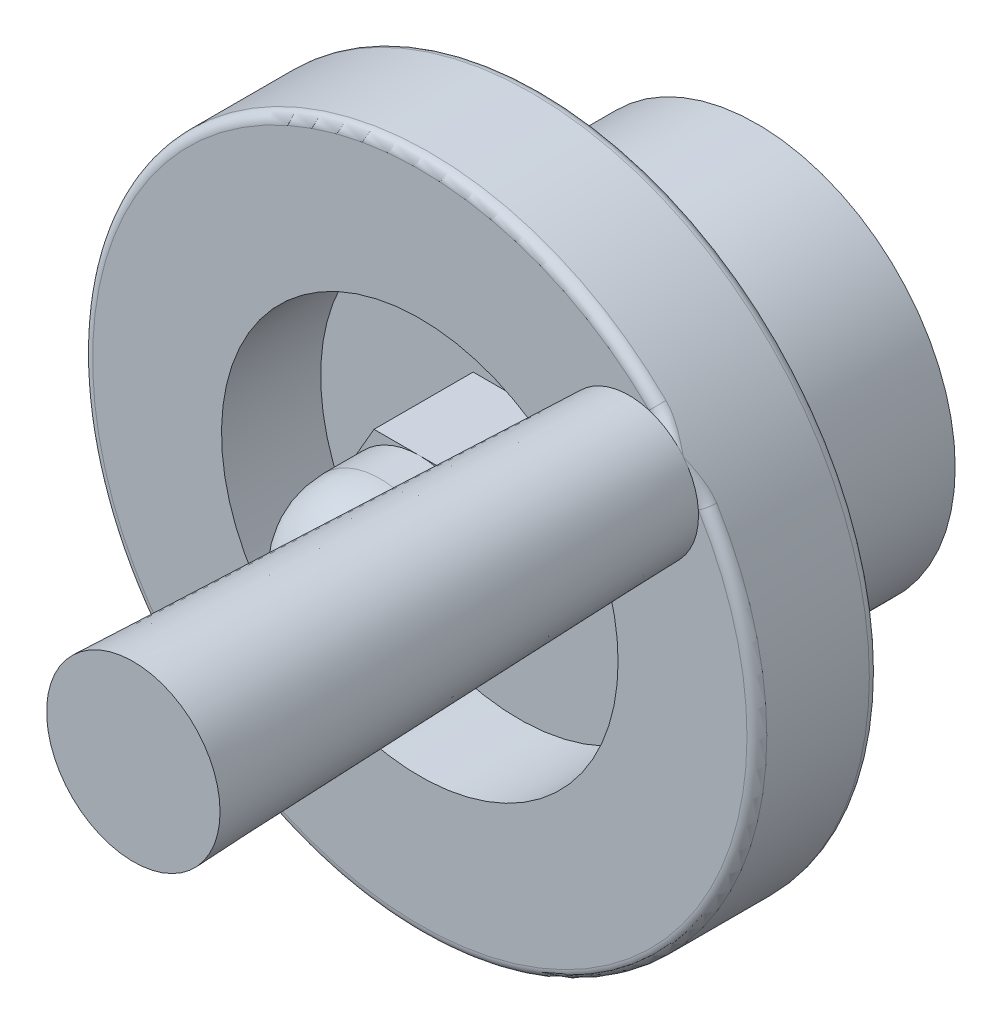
ISO-10303-21;
HEADER;
FILE_DESCRIPTION(('STEP AP214'),'2;1');
FILE_NAME('part.step','',(''),(''),'','','');
FILE_SCHEMA(('AUTOMOTIVE_DESIGN { 1 0 10303 214 1 1 1 1 }'));
ENDSEC;
DATA;
#1=APPLICATION_CONTEXT('core data for automotive mechanical design processes');
#2=APPLICATION_PROTOCOL_DEFINITION('international standard','automotive_design',2000,#1);
#3=PRODUCT_CONTEXT('',#1,'mechanical');
#4=PRODUCT('Part','Part','',(#3));
#5=PRODUCT_RELATED_PRODUCT_CATEGORY('part','',(#4));
#6=PRODUCT_DEFINITION_FORMATION('','',#4);
#7=PRODUCT_DEFINITION_CONTEXT('part definition',#1,'design');
#8=PRODUCT_DEFINITION('design','',#6,#7);
#9=PRODUCT_DEFINITION_SHAPE('','',#8);
#10=(LENGTH_UNIT() NAMED_UNIT(*) SI_UNIT(.MILLI.,.METRE.));
#11=(NAMED_UNIT(*) PLANE_ANGLE_UNIT() SI_UNIT($,.RADIAN.));
#12=(NAMED_UNIT(*) SI_UNIT($,.STERADIAN.) SOLID_ANGLE_UNIT());
#13=UNCERTAINTY_MEASURE_WITH_UNIT(LENGTH_MEASURE(1.E-05),#10,'distance_accuracy_value','');
#14=(GEOMETRIC_REPRESENTATION_CONTEXT(3) GLOBAL_UNCERTAINTY_ASSIGNED_CONTEXT((#13)) GLOBAL_UNIT_ASSIGNED_CONTEXT((#10,
#11,#12)) REPRESENTATION_CONTEXT('',''));
#15=CARTESIAN_POINT('',(0.,0.,0.));
#16=DIRECTION('',(0.,0.,1.));
#17=DIRECTION('',(1.,0.,0.));
#18=AXIS2_PLACEMENT_3D('',#15,#16,#17);
#19=CARTESIAN_POINT('',(0.,0.,17.));
#20=DIRECTION('',(0.,0.,1.));
#21=DIRECTION('',(1.,0.,0.));
#22=AXIS2_PLACEMENT_3D('',#19,#20,#21);
#23=PLANE('',#22);
#24=CARTESIAN_POINT('',(0.,0.,17.));
#25=DIRECTION('',(0.,0.,1.));
#26=DIRECTION('',(1.,0.,0.));
#27=AXIS2_PLACEMENT_3D('',#24,#25,#26);
#28=CIRCLE('',#27,4.);
#29=CARTESIAN_POINT('',(3.46410161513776,2.,17.));
#30=VERTEX_POINT('',#29);
#31=CARTESIAN_POINT('',(0.,4.00000000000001,17.));
#32=VERTEX_POINT('',#31);
#33=EDGE_CURVE('E163',#30,#32,#28,.T.);
#34=ORIENTED_EDGE('',*,*,#33,.F.);
#35=DIRECTION('',(-0.5,0.866025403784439,0.));
#36=VECTOR('',#35,1.);
#37=CARTESIAN_POINT('',(4.61880215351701,0.,17.));
#38=LINE('',#37,#36);
#39=CARTESIAN_POINT('',(2.3094010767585,4.00000000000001,17.));
#40=VERTEX_POINT('',#39);
#41=EDGE_CURVE('E291',#30,#40,#38,.T.);
#42=ORIENTED_EDGE('',*,*,#41,.T.);
#43=DIRECTION('',(-1.,0.,0.));
#44=VECTOR('',#43,1.);
#45=CARTESIAN_POINT('',(2.3094010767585,4.00000000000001,17.));
#46=LINE('',#45,#44);
#47=EDGE_CURVE('E294',#40,#32,#46,.T.);
#48=ORIENTED_EDGE('',*,*,#47,.T.);
#49=EDGE_LOOP('',(#34,#42,#48));
#50=FACE_BOUND('',#49,.T.);
#51=ADVANCED_FACE('F46',(#50),#23,.T.);
#52=CARTESIAN_POINT('',(-3.46410161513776,2.,17.));
#53=VERTEX_POINT('',#52);
#54=EDGE_CURVE('E299',#32,#53,#28,.T.);
#55=ORIENTED_EDGE('',*,*,#54,.F.);
#56=CARTESIAN_POINT('',(-2.3094010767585,4.00000000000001,17.));
#57=VERTEX_POINT('',#56);
#58=EDGE_CURVE('E318',#32,#57,#46,.T.);
#59=ORIENTED_EDGE('',*,*,#58,.T.);
#60=DIRECTION('',(-0.5,-0.866025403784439,0.));
#61=VECTOR('',#60,1.);
#62=CARTESIAN_POINT('',(-2.3094010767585,4.00000000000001,17.));
#63=LINE('',#62,#61);
#64=EDGE_CURVE('E321',#57,#53,#63,.T.);
#65=ORIENTED_EDGE('',*,*,#64,.T.);
#66=EDGE_LOOP('',(#55,#59,#65));
#67=FACE_BOUND('',#66,.T.);
#68=ADVANCED_FACE('F279',(#67),#23,.T.);
#69=CARTESIAN_POINT('',(-3.46410161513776,-2.,17.));
#70=VERTEX_POINT('',#69);
#71=EDGE_CURVE('E659',#53,#70,#28,.T.);
#72=ORIENTED_EDGE('',*,*,#71,.F.);
#73=CARTESIAN_POINT('',(-4.61880215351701,0.,17.));
#74=VERTEX_POINT('',#73);
#75=EDGE_CURVE('E320',#53,#74,#63,.T.);
#76=ORIENTED_EDGE('',*,*,#75,.T.);
#77=DIRECTION('',(0.5,-0.866025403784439,0.));
#78=VECTOR('',#77,1.);
#79=CARTESIAN_POINT('',(-4.61880215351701,0.,17.));
#80=LINE('',#79,#78);
#81=EDGE_CURVE('E325',#74,#70,#80,.T.);
#82=ORIENTED_EDGE('',*,*,#81,.T.);
#83=EDGE_LOOP('',(#72,#76,#82));
#84=FACE_BOUND('',#83,.T.);
#85=ADVANCED_FACE('F284',(#84),#23,.T.);
#86=CARTESIAN_POINT('',(0.,-4.00000000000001,17.));
#87=VERTEX_POINT('',#86);
#88=EDGE_CURVE('E306',#70,#87,#28,.T.);
#89=ORIENTED_EDGE('',*,*,#88,.F.);
#90=CARTESIAN_POINT('',(-2.3094010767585,-4.00000000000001,17.));
#91=VERTEX_POINT('',#90);
#92=EDGE_CURVE('E324',#70,#91,#80,.T.);
#93=ORIENTED_EDGE('',*,*,#92,.T.);
#94=DIRECTION('',(1.,0.,0.));
#95=VECTOR('',#94,1.);
#96=CARTESIAN_POINT('',(-2.3094010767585,-4.00000000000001,17.));
#97=LINE('',#96,#95);
#98=EDGE_CURVE('E329',#91,#87,#97,.T.);
#99=ORIENTED_EDGE('',*,*,#98,.T.);
#100=EDGE_LOOP('',(#89,#93,#99));
#101=FACE_BOUND('',#100,.T.);
#102=ADVANCED_FACE('F549',(#101),#23,.T.);
#103=CARTESIAN_POINT('',(3.46410161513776,-2.,17.));
#104=VERTEX_POINT('',#103);
#105=EDGE_CURVE('E303',#87,#104,#28,.T.);
#106=ORIENTED_EDGE('',*,*,#105,.F.);
#107=CARTESIAN_POINT('',(2.3094010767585,-4.00000000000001,17.));
#108=VERTEX_POINT('',#107);
#109=EDGE_CURVE('E328',#87,#108,#97,.T.);
#110=ORIENTED_EDGE('',*,*,#109,.T.);
#111=DIRECTION('',(0.5,0.866025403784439,0.));
#112=VECTOR('',#111,1.);
#113=CARTESIAN_POINT('',(2.3094010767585,-4.00000000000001,17.));
#114=LINE('',#113,#112);
#115=EDGE_CURVE('E312',#108,#104,#114,.T.);
#116=ORIENTED_EDGE('',*,*,#115,.T.);
#117=EDGE_LOOP('',(#106,#110,#116));
#118=FACE_BOUND('',#117,.T.);
#119=ADVANCED_FACE('F241',(#118),#23,.T.);
#120=CARTESIAN_POINT('',(0.,0.,12.));
#121=DIRECTION('',(0.,0.,1.));
#122=DIRECTION('',(1.,0.,0.));
#123=AXIS2_PLACEMENT_3D('',#120,#121,#122);
#124=PLANE('',#123);
#125=CARTESIAN_POINT('',(0.,0.,12.));
#126=DIRECTION('',(0.,0.,1.));
#127=DIRECTION('',(1.,0.,0.));
#128=AXIS2_PLACEMENT_3D('',#125,#126,#127);
#129=CIRCLE('',#128,10.);
#130=CARTESIAN_POINT('',(10.,0.,12.));
#131=VERTEX_POINT('',#130);
#132=EDGE_CURVE('E308',#131,#131,#129,.T.);
#133=ORIENTED_EDGE('',*,*,#132,.T.);
#134=EDGE_LOOP('',(#133));
#135=FACE_BOUND('',#134,.T.);
#136=DIRECTION('',(-0.5,0.866025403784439,0.));
#137=VECTOR('',#136,1.);
#138=CARTESIAN_POINT('',(4.61880215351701,0.,12.));
#139=LINE('',#138,#137);
#140=CARTESIAN_POINT('',(4.61880215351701,0.,12.));
#141=VERTEX_POINT('',#140);
#142=CARTESIAN_POINT('',(2.3094010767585,4.00000000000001,12.));
#143=VERTEX_POINT('',#142);
#144=EDGE_CURVE('E336',#141,#143,#139,.T.);
#145=ORIENTED_EDGE('',*,*,#144,.F.);
#146=DIRECTION('',(0.5,0.866025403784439,0.));
#147=VECTOR('',#146,1.);
#148=CARTESIAN_POINT('',(2.3094010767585,-4.00000000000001,12.));
#149=LINE('',#148,#147);
#150=CARTESIAN_POINT('',(2.3094010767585,-4.00000000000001,12.));
#151=VERTEX_POINT('',#150);
#152=EDGE_CURVE('E333',#151,#141,#149,.T.);
#153=ORIENTED_EDGE('',*,*,#152,.F.);
#154=DIRECTION('',(1.,0.,0.));
#155=VECTOR('',#154,1.);
#156=CARTESIAN_POINT('',(-2.3094010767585,-4.00000000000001,12.));
#157=LINE('',#156,#155);
#158=CARTESIAN_POINT('',(-2.3094010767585,-4.00000000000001,12.));
#159=VERTEX_POINT('',#158);
#160=EDGE_CURVE('E345',#159,#151,#157,.T.);
#161=ORIENTED_EDGE('',*,*,#160,.F.);
#162=DIRECTION('',(0.5,-0.866025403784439,0.));
#163=VECTOR('',#162,1.);
#164=CARTESIAN_POINT('',(-4.61880215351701,0.,12.));
#165=LINE('',#164,#163);
#166=CARTESIAN_POINT('',(-4.61880215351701,0.,12.));
#167=VERTEX_POINT('',#166);
#168=EDGE_CURVE('E342',#167,#159,#165,.T.);
#169=ORIENTED_EDGE('',*,*,#168,.F.);
#170=DIRECTION('',(-0.5,-0.866025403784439,0.));
#171=VECTOR('',#170,1.);
#172=CARTESIAN_POINT('',(-2.3094010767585,4.00000000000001,12.));
#173=LINE('',#172,#171);
#174=CARTESIAN_POINT('',(-2.3094010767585,4.00000000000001,12.));
#175=VERTEX_POINT('',#174);
#176=EDGE_CURVE('E340',#175,#167,#173,.T.);
#177=ORIENTED_EDGE('',*,*,#176,.F.);
#178=DIRECTION('',(-1.,0.,0.));
#179=VECTOR('',#178,1.);
#180=CARTESIAN_POINT('',(2.3094010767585,4.00000000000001,12.));
#181=LINE('',#180,#179);
#182=EDGE_CURVE('E338',#143,#175,#181,.T.);
#183=ORIENTED_EDGE('',*,*,#182,.F.);
#184=EDGE_LOOP('',(#145,#153,#161,#169,#177,#183));
#185=FACE_BOUND('',#184,.T.);
#186=ADVANCED_FACE('F266',(#135,#185),#124,.T.);
#187=CARTESIAN_POINT('',(0.,0.,8.));
#188=DIRECTION('',(0.,0.,-1.));
#189=DIRECTION('',(-1.,0.,0.));
#190=AXIS2_PLACEMENT_3D('',#187,#188,#189);
#191=CYLINDRICAL_SURFACE('',#190,10.);
#192=CARTESIAN_POINT('',(0.,0.,7.67030192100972));
#193=DIRECTION('',(0.,0.,1.));
#194=DIRECTION('',(1.,0.,0.));
#195=AXIS2_PLACEMENT_3D('',#192,#193,#194);
#196=CIRCLE('',#195,10.);
#197=CARTESIAN_POINT('',(10.,0.,7.67030192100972));
#198=VERTEX_POINT('',#197);
#199=EDGE_CURVE('E370',#198,#198,#196,.F.);
#200=ORIENTED_EDGE('',*,*,#199,.T.);
#201=EDGE_LOOP('',(#200));
#202=FACE_BOUND('',#201,.T.);
#203=CARTESIAN_POINT('',(0.,0.,0.));
#204=DIRECTION('',(0.,0.,1.));
#205=DIRECTION('',(1.,0.,0.));
#206=AXIS2_PLACEMENT_3D('',#203,#204,#205);
#207=CIRCLE('',#206,10.);
#208=CARTESIAN_POINT('',(10.,0.,0.));
#209=VERTEX_POINT('',#208);
#210=EDGE_CURVE('E305',#209,#209,#207,.T.);
#211=ORIENTED_EDGE('',*,*,#210,.T.);
#212=EDGE_LOOP('',(#211));
#213=FACE_BOUND('',#212,.T.);
#214=ADVANCED_FACE('F268',(#202,#213),#191,.T.);
#215=CARTESIAN_POINT('',(0.,0.,0.));
#216=DIRECTION('',(0.,0.,1.));
#217=DIRECTION('',(1.,0.,0.));
#218=AXIS2_PLACEMENT_3D('',#215,#216,#217);
#219=PLANE('',#218);
#220=ORIENTED_EDGE('',*,*,#210,.F.);
#221=EDGE_LOOP('',(#220));
#222=FACE_BOUND('',#221,.T.);
#223=ADVANCED_FACE('F396',(#222),#219,.F.);
#224=CARTESIAN_POINT('',(0.,0.,8.));
#225=DIRECTION('',(0.,0.,1.));
#226=DIRECTION('',(1.,0.,0.));
#227=AXIS2_PLACEMENT_3D('',#224,#225,#226);
#228=CONICAL_SURFACE('',#227,10.,1.16590454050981);
#229=CARTESIAN_POINT('',(0.,0.,10.8701255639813));
#230=DIRECTION('',(0.,0.,-1.));
#231=DIRECTION('',(-1.,0.,0.));
#232=AXIS2_PLACEMENT_3D('',#229,#230,#231);
#233=CIRCLE('',#232,16.6969596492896);
#234=CARTESIAN_POINT('',(-16.6969596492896,0.,10.8701255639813));
#235=VERTEX_POINT('',#234);
#236=EDGE_CURVE('E153',#235,#235,#233,.T.);
#237=ORIENTED_EDGE('',*,*,#236,.T.);
#238=EDGE_LOOP('',(#237));
#239=FACE_BOUND('',#238,.T.);
#240=CARTESIAN_POINT('',(0.,0.,8.12987443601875));
#241=DIRECTION('',(0.,0.,1.));
#242=DIRECTION('',(1.,0.,0.));
#243=AXIS2_PLACEMENT_3D('',#240,#241,#242);
#244=CIRCLE('',#243,10.3030403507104);
#245=CARTESIAN_POINT('',(10.3030403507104,0.,8.12987443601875));
#246=VERTEX_POINT('',#245);
#247=EDGE_CURVE('E367',#246,#246,#244,.T.);
#248=ORIENTED_EDGE('',*,*,#247,.T.);
#249=EDGE_LOOP('',(#248));
#250=FACE_BOUND('',#249,.T.);
#251=ADVANCED_FACE('F379',(#239,#250),#228,.T.);
#252=CARTESIAN_POINT('',(0.,0.,17.));
#253=DIRECTION('',(0.,0.,-1.));
#254=DIRECTION('',(-1.,0.,0.));
#255=AXIS2_PLACEMENT_3D('',#252,#253,#254);
#256=CYLINDRICAL_SURFACE('',#255,17.);
#257=CARTESIAN_POINT('',(0.,0.,11.3296980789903));
#258=DIRECTION('',(0.,0.,-1.));
#259=DIRECTION('',(-1.,0.,0.));
#260=AXIS2_PLACEMENT_3D('',#257,#258,#259);
#261=CIRCLE('',#260,17.);
#262=CARTESIAN_POINT('',(-17.,0.,11.3296980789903));
#263=VERTEX_POINT('',#262);
#264=EDGE_CURVE('E372',#263,#263,#261,.F.);
#265=ORIENTED_EDGE('',*,*,#264,.T.);
#266=EDGE_LOOP('',(#265));
#267=FACE_BOUND('',#266,.T.);
#268=CARTESIAN_POINT('',(11.208910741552,11.8554979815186,17.));
#269=CARTESIAN_POINT('',(11.7260341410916,12.3099291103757,17.2641014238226));
#270=CARTESIAN_POINT('',(11.5906877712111,12.4360748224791,16.5503490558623));
#271=CARTESIAN_POINT('',(11.2435567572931,11.8489095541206,17.));
#272=CARTESIAN_POINT('',(11.7344733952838,12.3014153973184,17.22844689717));
#273=CARTESIAN_POINT('',(11.6240760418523,12.4049590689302,16.5389080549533));
#274=CARTESIAN_POINT('',(11.2790888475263,11.8416017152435,17.));
#275=CARTESIAN_POINT('',(11.7481123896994,12.2881130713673,17.1946400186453));
#276=CARTESIAN_POINT('',(11.6577196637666,12.373348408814,16.5297454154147));
#277=CARTESIAN_POINT('',(11.3515185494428,11.825472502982,17.));
#278=CARTESIAN_POINT('',(11.7823713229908,12.2548833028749,17.1333594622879));
#279=CARTESIAN_POINT('',(11.725139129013,12.3094779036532,16.5153405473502));
#280=CARTESIAN_POINT('',(11.3884127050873,11.8166547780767,17.));
#281=CARTESIAN_POINT('',(11.8026921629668,12.2352384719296,17.105454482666));
#282=CARTESIAN_POINT('',(11.7589144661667,12.2772197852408,16.5100890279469));
#283=CARTESIAN_POINT('',(11.4998551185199,11.7880126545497,17.));
#284=CARTESIAN_POINT('',(11.8681547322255,12.1716794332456,17.0327428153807));
#285=CARTESIAN_POINT('',(11.859275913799,12.1805635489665,16.4992784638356));
#286=CARTESIAN_POINT('',(11.5760383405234,11.7658400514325,17.));
#287=CARTESIAN_POINT('',(11.9203806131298,12.1206799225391,16.9930483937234));
#288=CARTESIAN_POINT('',(11.9257397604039,12.115499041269,16.4984133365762));
#289=CARTESIAN_POINT('',(11.7535354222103,11.7071443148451,17.));
#290=CARTESIAN_POINT('',(12.0463615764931,11.9956472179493,16.9236680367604));
#291=CARTESIAN_POINT('',(12.0763354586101,11.9656371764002,16.5071033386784));
#292=CARTESIAN_POINT('',(11.8557166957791,11.6683232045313,17.));
#293=CARTESIAN_POINT('',(12.1238066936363,11.9175918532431,16.8966719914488));
#294=CARTESIAN_POINT('',(12.1599866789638,11.8806019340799,16.5197607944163));
#295=CARTESIAN_POINT('',(12.0615911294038,11.5781737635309,17.));
#296=CARTESIAN_POINT('',(12.2809222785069,11.7556153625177,16.8632797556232));
#297=CARTESIAN_POINT('',(12.3243143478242,11.7100530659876,16.555971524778));
#298=CARTESIAN_POINT('',(12.1652863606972,11.5268264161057,17.));
#299=CARTESIAN_POINT('',(12.3615358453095,11.6709282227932,16.8554661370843));
#300=CARTESIAN_POINT('',(12.4049860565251,11.6245389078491,16.5795414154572));
#301=CARTESIAN_POINT('',(12.3722118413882,11.4106381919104,17.));
#302=CARTESIAN_POINT('',(12.5224777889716,11.4980221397,16.8534788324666));
#303=CARTESIAN_POINT('',(12.5640260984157,11.4524720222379,16.6346178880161));
#304=CARTESIAN_POINT('',(12.4754269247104,11.3456667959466,17.));
#305=CARTESIAN_POINT('',(12.6038655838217,11.4087959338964,16.8588269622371));
#306=CARTESIAN_POINT('',(12.6423631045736,11.3659174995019,16.6662019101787));
#307=CARTESIAN_POINT('',(12.6772912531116,11.2028171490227,17.));
#308=CARTESIAN_POINT('',(12.7642254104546,11.2290148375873,16.878365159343));
#309=CARTESIAN_POINT('',(12.7961111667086,11.1925404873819,16.7345659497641));
#310=CARTESIAN_POINT('',(12.7759430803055,11.1249463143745,17.));
#311=CARTESIAN_POINT('',(12.8441961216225,11.1374639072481,16.892397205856));
#312=CARTESIAN_POINT('',(12.8715238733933,11.1057181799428,16.7713429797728));
#313=CARTESIAN_POINT('',(12.94488881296,10.9758169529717,17.));
#314=CARTESIAN_POINT('',(12.9842449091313,10.973558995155,16.9217731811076));
#315=CARTESIAN_POINT('',(13.0034698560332,10.950694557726,16.8394726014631));
#316=CARTESIAN_POINT('',(13.0166289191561,10.9069052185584,17.));
#317=CARTESIAN_POINT('',(13.0450992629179,10.9011411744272,16.9361456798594));
#318=CARTESIAN_POINT('',(13.0604897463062,10.8826219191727,16.8702258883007));
#319=CARTESIAN_POINT('',(13.1542726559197,10.7628088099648,17.));
#320=CARTESIAN_POINT('',(13.165046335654,10.7559496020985,16.9662601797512));
#321=CARTESIAN_POINT('',(13.173103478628,10.7460300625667,16.9325830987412));
#322=CARTESIAN_POINT('',(13.2201900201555,10.6876397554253,17.));
#323=CARTESIAN_POINT('',(13.2245617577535,10.6826878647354,16.9820910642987));
#324=CARTESIAN_POINT('',(13.2287004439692,10.6775123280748,16.9641847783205));
#325=CARTESIAN_POINT('',(13.2855410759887,10.6063279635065,17.));
#326=CARTESIAN_POINT('',(13.2858683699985,10.6059285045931,16.9986015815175));
#327=CARTESIAN_POINT('',(13.2861904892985,10.6055248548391,16.9972031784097));
#328=CARTESIAN_POINT('',(13.288302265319,10.6028790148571,17.));
#329=CARTESIAN_POINT('',(13.2884632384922,10.6026771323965,16.9993007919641));
#330=CARTESIAN_POINT('',(13.28862421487,10.6024752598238,16.9986015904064));
#331=CARTESIAN_POINT('',(13.2910568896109,10.5994248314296,17.));
#332=CARTESIAN_POINT('',(13.2910568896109,10.5994248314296,17.));
#333=CARTESIAN_POINT('',(13.2910568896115,10.5994248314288,17.));
#334=(BOUNDED_SURFACE() B_SPLINE_SURFACE(3,2,((#268,#269,#270),(#271,#272,#273),(#274,#275,
#276),(#277,#278,#279),(#280,#281,#282),(#283,#284,#285),(#286,#287,#288),(#289,#290,#291),
(#292,#293,#294),(#295,#296,#297),(#298,#299,#300),(#301,#302,#303),(#304,#305,#306),(#307,#308,
#309),(#310,#311,#312),(#313,#314,#315),(#316,#317,#318),(#319,#320,#321),(#322,#323,#324),
(#325,#326,#327),(#328,#329,#330),(#331,#332,#333)),.UNSPECIFIED.,.F.,.F.,
.F.) B_SPLINE_SURFACE_WITH_KNOTS((4,2,2,2,2,2,2,2,2,2,4),(3,3),(0.,0.137077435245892,
0.273828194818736,0.543931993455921,0.89255617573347,1.24171295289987,1.59438142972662,
1.94684784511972,2.22135807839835,2.49520251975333,2.50731312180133),(0.,1.),
.UNSPECIFIED.) GEOMETRIC_REPRESENTATION_ITEM() RATIONAL_B_SPLINE_SURFACE(((1.,0.561240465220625,
1.),(1.,0.578262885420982,1.),(1.,0.594654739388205,1.),(1.,0.62620752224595,1.),(1.,
0.641371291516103,1.),(1.,0.684819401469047,1.),(1.,0.711478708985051,1.),(1.,0.768080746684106,
1.),(1.,0.796725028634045,1.),(1.,0.848207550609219,1.),(1.,0.871036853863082,1.),(1.,
0.911314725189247,1.),(1.,0.92870686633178,1.),(1.,0.957868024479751,1.),(1.,0.969640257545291,
1.),(1.,0.985583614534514,1.),(1.,0.990860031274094,1.),(1.,0.997983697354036,1.),(1.,
0.999839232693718,1.),(1.,0.999996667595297,1.),(1.,1.00000000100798,1.),(1.,1.,1.))) REPRESENTATION_ITEM('') SURFACE());
#335=CARTESIAN_POINT('',(11.5906877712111,12.4360748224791,16.5503490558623));
#336=CARTESIAN_POINT('',(11.6240760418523,12.4049590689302,16.5389080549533));
#337=CARTESIAN_POINT('',(11.6577196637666,12.373348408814,16.5297454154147));
#338=CARTESIAN_POINT('',(11.725139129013,12.3094779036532,16.5153405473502));
#339=CARTESIAN_POINT('',(11.7589144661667,12.2772197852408,16.5100890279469));
#340=CARTESIAN_POINT('',(11.859275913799,12.1805635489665,16.4992784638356));
#341=CARTESIAN_POINT('',(11.9257397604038,12.115499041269,16.4984133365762));
#342=CARTESIAN_POINT('',(12.0763354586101,11.9656371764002,16.5071033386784));
#343=CARTESIAN_POINT('',(12.1599866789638,11.8806019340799,16.5197607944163));
#344=CARTESIAN_POINT('',(12.3243143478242,11.7100530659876,16.555971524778));
#345=CARTESIAN_POINT('',(12.4049860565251,11.6245389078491,16.5795414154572));
#346=CARTESIAN_POINT('',(12.5640260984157,11.4524720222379,16.6346178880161));
#347=CARTESIAN_POINT('',(12.6423631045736,11.3659174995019,16.6662019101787));
#348=CARTESIAN_POINT('',(12.7961111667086,11.1925404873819,16.7345659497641));
#349=CARTESIAN_POINT('',(12.8715238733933,11.1057181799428,16.7713429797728));
#350=CARTESIAN_POINT('',(13.0034698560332,10.950694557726,16.8394726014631));
#351=CARTESIAN_POINT('',(13.0604897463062,10.8826219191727,16.8702258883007));
#352=CARTESIAN_POINT('',(13.173103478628,10.7460300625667,16.9325830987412));
#353=CARTESIAN_POINT('',(13.2287004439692,10.6775123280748,16.9641847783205));
#354=CARTESIAN_POINT('',(13.2861904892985,10.6055248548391,16.9972031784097));
#355=CARTESIAN_POINT('',(13.28862421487,10.6024752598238,16.9986015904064));
#356=CARTESIAN_POINT('',(13.2910568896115,10.5994248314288,17.));
#357=B_SPLINE_CURVE_WITH_KNOTS('',3,(#335,#336,#337,#338,#339,#340,#341,#342,#343,#344,#345,
#346,#347,#348,#349,#350,#351,#352,#353,#354,#355,#356),.UNSPECIFIED.,.F.,.F.,(4,2,2,2,2,2,2,2,
2,2,4),(0.,0.137077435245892,0.273828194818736,0.543931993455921,0.89255617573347,
1.24171295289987,1.59438142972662,1.94684784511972,2.22135807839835,2.49520251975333,
2.50731312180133),.UNSPECIFIED.);
#358=CARTESIAN_POINT('',(11.9161235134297,12.1246031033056,16.5));
#359=VERTEX_POINT('',#358);
#360=CARTESIAN_POINT('',(13.2910568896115,10.5994248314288,17.));
#361=VERTEX_POINT('',#360);
#362=EDGE_CURVE('E134',#359,#361,#357,.T.);
#363=ORIENTED_EDGE('',*,*,#362,.T.);
#364=CARTESIAN_POINT('',(14.70332104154,8.53301531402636,16.5503490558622));
#365=CARTESIAN_POINT('',(14.610453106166,8.69303694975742,17.2641014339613));
#366=CARTESIAN_POINT('',(14.0523506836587,8.28999110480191,17.));
#367=CARTESIAN_POINT('',(14.6804144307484,8.5724900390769,16.5389080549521));
#368=CARTESIAN_POINT('',(14.6040306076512,8.70315900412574,17.2284469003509));
#369=CARTESIAN_POINT('',(14.0536363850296,8.32523456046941,17.));
#370=CARTESIAN_POINT('',(14.6570821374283,8.6123238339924,16.5297454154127));
#371=CARTESIAN_POINT('',(14.594096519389,8.71941594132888,17.194640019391));
#372=CARTESIAN_POINT('',(14.0544178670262,8.36150194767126,17.));
#373=CARTESIAN_POINT('',(14.6098140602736,8.69226477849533,16.5153405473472));
#374=CARTESIAN_POINT('',(14.5693226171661,8.76020988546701,17.1333594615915));
#375=CARTESIAN_POINT('',(14.0548090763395,8.43570478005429,17.));
#376=CARTESIAN_POINT('',(14.5858798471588,8.7323710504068,16.5100890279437));
#377=CARTESIAN_POINT('',(14.5546917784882,8.78439240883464,17.1054544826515));
#378=CARTESIAN_POINT('',(14.0544215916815,8.47363604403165,17.));
#379=CARTESIAN_POINT('',(14.5139777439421,8.85172320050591,16.4992784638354));
#380=CARTESIAN_POINT('',(14.5072919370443,8.86235621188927,17.0327428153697));
#381=CARTESIAN_POINT('',(14.0512941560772,8.5886577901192,17.));
#382=CARTESIAN_POINT('',(14.4653329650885,8.93099815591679,16.4984133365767));
#383=CARTESIAN_POINT('',(14.4691915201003,8.92462058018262,16.99304839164));
#384=CARTESIAN_POINT('',(14.0466286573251,8.66786474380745,17.));
#385=CARTESIAN_POINT('',(14.3527364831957,9.11116384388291,16.5071033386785));
#386=CARTESIAN_POINT('',(14.3753248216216,9.07526394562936,16.9236680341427));
#387=CARTESIAN_POINT('',(14.0288986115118,8.85397237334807,17.));
#388=CARTESIAN_POINT('',(14.2884459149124,9.21163892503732,16.5197607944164));
#389=CARTESIAN_POINT('',(14.3164582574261,9.16813543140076,16.8966719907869));
#390=CARTESIAN_POINT('',(14.0137867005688,8.96223003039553,17.));
#391=CARTESIAN_POINT('',(14.1587364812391,9.4097953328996,16.5559715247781));
#392=CARTESIAN_POINT('',(14.1935015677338,9.35735314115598,16.8632797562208));
#393=CARTESIAN_POINT('',(13.9717056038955,9.18300227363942,17.));
#394=CARTESIAN_POINT('',(14.0933160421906,9.50747215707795,16.5795414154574));
#395=CARTESIAN_POINT('',(14.1288744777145,9.45478926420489,16.8554661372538));
#396=CARTESIAN_POINT('',(13.9447183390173,9.29552311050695,17.));
#397=CARTESIAN_POINT('',(13.9609501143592,9.70081126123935,16.6346178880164));
#398=CARTESIAN_POINT('',(13.9961135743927,9.65016932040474,16.8534788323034));
#399=CARTESIAN_POINT('',(13.8774850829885,9.52311385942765,17.));
#400=CARTESIAN_POINT('',(13.893995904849,9.79644339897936,16.666201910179));
#401=CARTESIAN_POINT('',(13.9272334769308,9.74937023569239,16.8588269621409));
#402=CARTESIAN_POINT('',(13.8371084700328,9.63819802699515,17.));
#403=CARTESIAN_POINT('',(13.7591751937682,9.98491469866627,16.7345659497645));
#404=CARTESIAN_POINT('',(13.7876403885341,9.94571249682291,16.8783651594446));
#405=CARTESIAN_POINT('',(13.7427560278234,9.86678682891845,17.));
#406=CARTESIAN_POINT('',(13.6913092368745,10.0777554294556,16.7713429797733));
#407=CARTESIAN_POINT('',(13.7161785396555,10.0440491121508,16.8923972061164));
#408=CARTESIAN_POINT('',(13.6887880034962,9.98029233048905,17.));
#409=CARTESIAN_POINT('',(13.5695307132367,10.2408874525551,16.8394726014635));
#410=CARTESIAN_POINT('',(13.5875442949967,10.217056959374,16.9217731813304));
#411=CARTESIAN_POINT('',(13.5809886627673,10.1781850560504,17.));
#412=CARTESIAN_POINT('',(13.5158518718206,10.3116245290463,16.870225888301));
#413=CARTESIAN_POINT('',(13.5304823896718,10.2924992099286,16.9361456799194));
#414=CARTESIAN_POINT('',(13.5297670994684,10.2634600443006,17.));
#415=CARTESIAN_POINT('',(13.4077414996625,10.4518077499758,16.9325830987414));
#416=CARTESIAN_POINT('',(13.4156196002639,10.4417454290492,16.966260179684));
#417=CARTESIAN_POINT('',(13.4199096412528,10.4297156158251,17.));
#418=CARTESIAN_POINT('',(13.3533121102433,10.5212566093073,16.9641847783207));
#419=CARTESIAN_POINT('',(13.3574370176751,10.5160700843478,16.9820910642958));
#420=CARTESIAN_POINT('',(13.3612920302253,10.5107061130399,17.));
#421=CARTESIAN_POINT('',(13.2959211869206,10.5933231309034,16.9972031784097));
#422=CARTESIAN_POINT('',(13.2962430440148,10.5929192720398,16.9986015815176));
#423=CARTESIAN_POINT('',(13.2965596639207,10.5925113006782,17.));
#424=CARTESIAN_POINT('',(13.2934895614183,10.5963744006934,16.9986015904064));
#425=CARTESIAN_POINT('',(13.2936505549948,10.5961725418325,16.9993007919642));
#426=CARTESIAN_POINT('',(13.2938115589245,10.5959706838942,17.));
#427=CARTESIAN_POINT('',(13.2910568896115,10.5994248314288,17.));
#428=CARTESIAN_POINT('',(13.2910568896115,10.5994248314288,17.));
#429=CARTESIAN_POINT('',(13.291056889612,10.5994248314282,17.));
#430=(BOUNDED_SURFACE() B_SPLINE_SURFACE(3,2,((#364,#365,#366),(#367,#368,#369),(#370,#371,
#372),(#373,#374,#375),(#376,#377,#378),(#379,#380,#381),(#382,#383,#384),(#385,#386,#387),
(#388,#389,#390),(#391,#392,#393),(#394,#395,#396),(#397,#398,#399),(#400,#401,#402),(#403,#404,
#405),(#406,#407,#408),(#409,#410,#411),(#412,#413,#414),(#415,#416,#417),(#418,#419,#420),
(#421,#422,#423),(#424,#425,#426),(#427,#428,#429)),.UNSPECIFIED.,.F.,.F.,
.F.) B_SPLINE_SURFACE_WITH_KNOTS((4,2,2,2,2,2,2,2,2,2,4),(3,3),(0.,0.13707743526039,
0.273828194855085,0.543931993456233,0.89255617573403,1.24171295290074,1.59438142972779,
1.94684784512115,2.22135807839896,2.4952025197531,2.50731312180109),(0.,1.),
.UNSPECIFIED.) GEOMETRIC_REPRESENTATION_ITEM() RATIONAL_B_SPLINE_SURFACE(((1.,0.561240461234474,
1.),(1.,0.578262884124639,1.),(1.,0.594654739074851,1.),(1.,0.62620752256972,1.),(1.,
0.641371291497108,1.),(1.,0.68481940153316,1.),(1.,0.711478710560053,1.),(1.,0.768080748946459,
1.),(1.,0.796725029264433,1.),(1.,0.848207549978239,1.),(1.,0.871036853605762,1.),(1.,
0.911314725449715,1.),(1.,0.928706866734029,1.),(1.,0.957868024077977,1.),(1.,0.969640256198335,
1.),(1.,0.985583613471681,1.),(1.,0.990860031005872,1.),(1.,0.997983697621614,1.),(1.,
0.999839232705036,1.),(1.,0.999996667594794,1.),(1.,1.00000000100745,1.),(1.,1.,1.))) REPRESENTATION_ITEM('') SURFACE());
#431=CARTESIAN_POINT('',(14.70332104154,8.53301531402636,16.5503490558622));
#432=CARTESIAN_POINT('',(14.6804144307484,8.57249003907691,16.5389080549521));
#433=CARTESIAN_POINT('',(14.6570821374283,8.6123238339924,16.5297454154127));
#434=CARTESIAN_POINT('',(14.6098140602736,8.69226477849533,16.5153405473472));
#435=CARTESIAN_POINT('',(14.5858798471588,8.7323710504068,16.5100890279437));
#436=CARTESIAN_POINT('',(14.5139777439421,8.85172320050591,16.4992784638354));
#437=CARTESIAN_POINT('',(14.4653329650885,8.93099815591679,16.4984133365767));
#438=CARTESIAN_POINT('',(14.3527364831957,9.11116384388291,16.5071033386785));
#439=CARTESIAN_POINT('',(14.2884459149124,9.21163892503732,16.5197607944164));
#440=CARTESIAN_POINT('',(14.1587364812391,9.4097953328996,16.5559715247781));
#441=CARTESIAN_POINT('',(14.0933160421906,9.50747215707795,16.5795414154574));
#442=CARTESIAN_POINT('',(13.9609501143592,9.70081126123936,16.6346178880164));
#443=CARTESIAN_POINT('',(13.893995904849,9.79644339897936,16.666201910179));
#444=CARTESIAN_POINT('',(13.7591751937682,9.98491469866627,16.7345659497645));
#445=CARTESIAN_POINT('',(13.6913092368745,10.0777554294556,16.7713429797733));
#446=CARTESIAN_POINT('',(13.5695307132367,10.2408874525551,16.8394726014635));
#447=CARTESIAN_POINT('',(13.5158518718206,10.3116245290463,16.870225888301));
#448=CARTESIAN_POINT('',(13.4077414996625,10.4518077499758,16.9325830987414));
#449=CARTESIAN_POINT('',(13.3533121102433,10.5212566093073,16.9641847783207));
#450=CARTESIAN_POINT('',(13.2959211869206,10.5933231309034,16.9972031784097));
#451=CARTESIAN_POINT('',(13.2934895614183,10.5963744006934,16.9986015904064));
#452=CARTESIAN_POINT('',(13.2910568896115,10.5994248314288,17.));
#453=B_SPLINE_CURVE_WITH_KNOTS('',3,(#431,#432,#433,#434,#435,#436,#437,#438,#439,#440,#441,
#442,#443,#444,#445,#446,#447,#448,#449,#450,#451,#452),.UNSPECIFIED.,.F.,.F.,(4,2,2,2,2,2,2,2,
2,2,4),(0.,0.13707743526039,0.273828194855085,0.543931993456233,0.89255617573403,
1.24171295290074,1.59438142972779,1.94684784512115,2.22135807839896,2.4952025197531,
2.50731312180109),.UNSPECIFIED.);
#454=CARTESIAN_POINT('',(14.4720691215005,8.91959726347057,16.5));
#455=VERTEX_POINT('',#454);
#456=EDGE_CURVE('E12',#361,#455,#453,.F.);
#457=ORIENTED_EDGE('',*,*,#456,.T.);
#458=CARTESIAN_POINT('',(0.,0.,16.5));
#459=DIRECTION('',(0.,0.,1.));
#460=DIRECTION('',(1.,0.,0.));
#461=AXIS2_PLACEMENT_3D('',#458,#459,#460);
#462=CIRCLE('',#461,17.);
#463=EDGE_CURVE('E59',#455,#359,#462,.F.);
#464=ORIENTED_EDGE('',*,*,#463,.T.);
#465=EDGE_LOOP('',(#363,#457,#464));
#466=FACE_BOUND('',#465,.T.);
#467=ADVANCED_FACE('F136',(#267,#466),#256,.T.);
#468=CARTESIAN_POINT('',(0.,0.,17.));
#469=DIRECTION('',(0.,0.,1.));
#470=DIRECTION('',(1.,0.,0.));
#471=AXIS2_PLACEMENT_3D('',#468,#469,#470);
#472=PLANE('',#471);
#473=CARTESIAN_POINT('',(10.5546628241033,8.41719030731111,17.));
#474=DIRECTION('',(0.,0.,1.));
#475=DIRECTION('',(1.,0.,0.));
#476=AXIS2_PLACEMENT_3D('',#473,#474,#475);
#477=CIRCLE('',#476,3.5);
#478=CARTESIAN_POINT('',(11.5656492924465,11.767997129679,17.));
#479=VERTEX_POINT('',#478);
#480=CARTESIAN_POINT('',(7.81826875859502,6.23495578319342,17.));
#481=VERTEX_POINT('',#480);
#482=EDGE_CURVE('E155',#479,#481,#477,.T.);
#483=ORIENTED_EDGE('',*,*,#482,.F.);
#484=CARTESIAN_POINT('',(0.,0.,17.));
#485=DIRECTION('',(0.,0.,1.));
#486=DIRECTION('',(1.,0.,0.));
#487=AXIS2_PLACEMENT_3D('',#484,#485,#486);
#488=CIRCLE('',#487,16.5);
#489=CARTESIAN_POINT('',(14.0464200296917,8.65725616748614,17.));
#490=VERTEX_POINT('',#489);
#491=EDGE_CURVE('E140',#479,#490,#488,.T.);
#492=ORIENTED_EDGE('',*,*,#491,.T.);
#493=EDGE_CURVE('E150',#481,#490,#477,.T.);
#494=ORIENTED_EDGE('',*,*,#493,.F.);
#495=CARTESIAN_POINT('',(0.,0.,17.));
#496=DIRECTION('',(0.,0.,1.));
#497=DIRECTION('',(1.,0.,0.));
#498=AXIS2_PLACEMENT_3D('',#495,#496,#497);
#499=CIRCLE('',#498,10.);
#500=EDGE_CURVE('E362',#481,#481,#499,.T.);
#501=ORIENTED_EDGE('',*,*,#500,.F.);
#502=EDGE_LOOP('',(#483,#492,#494,#501));
#503=FACE_BOUND('',#502,.T.);
#504=ADVANCED_FACE('F217',(#503),#472,.T.);
#505=CARTESIAN_POINT('',(0.,0.,12.));
#506=DIRECTION('',(0.,0.,1.));
#507=DIRECTION('',(1.,0.,0.));
#508=AXIS2_PLACEMENT_3D('',#505,#506,#507);
#509=CYLINDRICAL_SURFACE('',#508,10.);
#510=ORIENTED_EDGE('',*,*,#132,.F.);
#511=EDGE_LOOP('',(#510));
#512=FACE_BOUND('',#511,.T.);
#513=ORIENTED_EDGE('',*,*,#500,.T.);
#514=EDGE_LOOP('',(#513));
#515=FACE_BOUND('',#514,.T.);
#516=ADVANCED_FACE('F264',(#512,#515),#509,.F.);
#517=CARTESIAN_POINT('',(2.3094010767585,-4.00000000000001,17.));
#518=DIRECTION('',(-0.866025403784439,0.5,0.));
#519=DIRECTION('',(-0.5,-0.866025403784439,0.));
#520=AXIS2_PLACEMENT_3D('',#517,#518,#519);
#521=PLANE('',#520);
#522=ORIENTED_EDGE('',*,*,#152,.T.);
#523=DIRECTION('',(0.,0.,-1.));
#524=VECTOR('',#523,1.);
#525=CARTESIAN_POINT('',(4.61880215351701,0.,17.));
#526=LINE('',#525,#524);
#527=CARTESIAN_POINT('',(4.61880215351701,0.,17.));
#528=VERTEX_POINT('',#527);
#529=EDGE_CURVE('E360',#528,#141,#526,.T.);
#530=ORIENTED_EDGE('',*,*,#529,.F.);
#531=EDGE_CURVE('E315',#104,#528,#114,.T.);
#532=ORIENTED_EDGE('',*,*,#531,.F.);
#533=ORIENTED_EDGE('',*,*,#115,.F.);
#534=DIRECTION('',(0.,0.,-1.));
#535=VECTOR('',#534,1.);
#536=CARTESIAN_POINT('',(2.3094010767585,-4.00000000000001,17.));
#537=LINE('',#536,#535);
#538=EDGE_CURVE('E332',#108,#151,#537,.T.);
#539=ORIENTED_EDGE('',*,*,#538,.T.);
#540=EDGE_LOOP('',(#522,#530,#532,#533,#539));
#541=FACE_BOUND('',#540,.T.);
#542=ADVANCED_FACE('F260',(#541),#521,.F.);
#543=CARTESIAN_POINT('',(4.61880215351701,0.,17.));
#544=DIRECTION('',(-0.866025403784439,-0.5,0.));
#545=DIRECTION('',(0.5,-0.866025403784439,0.));
#546=AXIS2_PLACEMENT_3D('',#543,#544,#545);
#547=PLANE('',#546);
#548=ORIENTED_EDGE('',*,*,#144,.T.);
#549=DIRECTION('',(0.,0.,-1.));
#550=VECTOR('',#549,1.);
#551=CARTESIAN_POINT('',(2.3094010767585,4.00000000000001,17.));
#552=LINE('',#551,#550);
#553=EDGE_CURVE('E357',#40,#143,#552,.T.);
#554=ORIENTED_EDGE('',*,*,#553,.F.);
#555=ORIENTED_EDGE('',*,*,#41,.F.);
#556=EDGE_CURVE('E316',#528,#30,#38,.T.);
#557=ORIENTED_EDGE('',*,*,#556,.F.);
#558=ORIENTED_EDGE('',*,*,#529,.T.);
#559=EDGE_LOOP('',(#548,#554,#555,#557,#558));
#560=FACE_BOUND('',#559,.T.);
#561=ADVANCED_FACE('F256',(#560),#547,.F.);
#562=CARTESIAN_POINT('',(2.3094010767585,4.00000000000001,17.));
#563=DIRECTION('',(0.,-1.,0.));
#564=DIRECTION('',(1.,0.,0.));
#565=AXIS2_PLACEMENT_3D('',#562,#563,#564);
#566=PLANE('',#565);
#567=ORIENTED_EDGE('',*,*,#182,.T.);
#568=DIRECTION('',(0.,0.,-1.));
#569=VECTOR('',#568,1.);
#570=CARTESIAN_POINT('',(-2.3094010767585,4.00000000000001,17.));
#571=LINE('',#570,#569);
#572=EDGE_CURVE('E354',#57,#175,#571,.T.);
#573=ORIENTED_EDGE('',*,*,#572,.F.);
#574=ORIENTED_EDGE('',*,*,#58,.F.);
#575=ORIENTED_EDGE('',*,*,#47,.F.);
#576=ORIENTED_EDGE('',*,*,#553,.T.);
#577=EDGE_LOOP('',(#567,#573,#574,#575,#576));
#578=FACE_BOUND('',#577,.T.);
#579=ADVANCED_FACE('F252',(#578),#566,.F.);
#580=CARTESIAN_POINT('',(-2.3094010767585,4.00000000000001,17.));
#581=DIRECTION('',(0.866025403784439,-0.5,0.));
#582=DIRECTION('',(0.5,0.866025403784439,0.));
#583=AXIS2_PLACEMENT_3D('',#580,#581,#582);
#584=PLANE('',#583);
#585=ORIENTED_EDGE('',*,*,#176,.T.);
#586=DIRECTION('',(0.,0.,-1.));
#587=VECTOR('',#586,1.);
#588=CARTESIAN_POINT('',(-4.61880215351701,0.,17.));
#589=LINE('',#588,#587);
#590=EDGE_CURVE('E351',#74,#167,#589,.T.);
#591=ORIENTED_EDGE('',*,*,#590,.F.);
#592=ORIENTED_EDGE('',*,*,#75,.F.);
#593=ORIENTED_EDGE('',*,*,#64,.F.);
#594=ORIENTED_EDGE('',*,*,#572,.T.);
#595=EDGE_LOOP('',(#585,#591,#592,#593,#594));
#596=FACE_BOUND('',#595,.T.);
#597=ADVANCED_FACE('F248',(#596),#584,.F.);
#598=CARTESIAN_POINT('',(-4.61880215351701,0.,17.));
#599=DIRECTION('',(0.866025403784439,0.5,0.));
#600=DIRECTION('',(-0.5,0.866025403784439,0.));
#601=AXIS2_PLACEMENT_3D('',#598,#599,#600);
#602=PLANE('',#601);
#603=ORIENTED_EDGE('',*,*,#168,.T.);
#604=DIRECTION('',(0.,0.,-1.));
#605=VECTOR('',#604,1.);
#606=CARTESIAN_POINT('',(-2.3094010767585,-4.00000000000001,17.));
#607=LINE('',#606,#605);
#608=EDGE_CURVE('E349',#91,#159,#607,.T.);
#609=ORIENTED_EDGE('',*,*,#608,.F.);
#610=ORIENTED_EDGE('',*,*,#92,.F.);
#611=ORIENTED_EDGE('',*,*,#81,.F.);
#612=ORIENTED_EDGE('',*,*,#590,.T.);
#613=EDGE_LOOP('',(#603,#609,#610,#611,#612));
#614=FACE_BOUND('',#613,.T.);
#615=ADVANCED_FACE('F244',(#614),#602,.F.);
#616=CARTESIAN_POINT('',(-2.3094010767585,-4.00000000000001,17.));
#617=DIRECTION('',(0.,1.,0.));
#618=DIRECTION('',(0.,0.,1.));
#619=AXIS2_PLACEMENT_3D('',#616,#617,#618);
#620=PLANE('',#619);
#621=ORIENTED_EDGE('',*,*,#160,.T.);
#622=ORIENTED_EDGE('',*,*,#538,.F.);
#623=ORIENTED_EDGE('',*,*,#109,.F.);
#624=ORIENTED_EDGE('',*,*,#98,.F.);
#625=ORIENTED_EDGE('',*,*,#608,.T.);
#626=EDGE_LOOP('',(#621,#622,#623,#624,#625));
#627=FACE_BOUND('',#626,.T.);
#628=ADVANCED_FACE('F239',(#627),#620,.F.);
#629=EDGE_CURVE('E300',#104,#30,#28,.T.);
#630=ORIENTED_EDGE('',*,*,#629,.F.);
#631=ORIENTED_EDGE('',*,*,#531,.T.);
#632=ORIENTED_EDGE('',*,*,#556,.T.);
#633=EDGE_LOOP('',(#630,#631,#632));
#634=FACE_BOUND('',#633,.T.);
#635=ADVANCED_FACE('F235',(#634),#23,.T.);
#636=CARTESIAN_POINT('',(0.,0.,19.));
#637=DIRECTION('',(0.,0.,-1.));
#638=DIRECTION('',(-1.,0.,0.));
#639=AXIS2_PLACEMENT_3D('',#636,#637,#638);
#640=CYLINDRICAL_SURFACE('',#639,4.);
#641=CARTESIAN_POINT('',(0.,0.,19.));
#642=DIRECTION('',(0.,0.,1.));
#643=DIRECTION('',(1.,0.,0.));
#644=AXIS2_PLACEMENT_3D('',#641,#642,#643);
#645=CIRCLE('',#644,4.);
#646=CARTESIAN_POINT('',(4.,0.,19.));
#647=VERTEX_POINT('',#646);
#648=EDGE_CURVE('E297',#647,#647,#645,.T.);
#649=ORIENTED_EDGE('',*,*,#648,.F.);
#650=EDGE_LOOP('',(#649));
#651=FACE_BOUND('',#650,.T.);
#652=ORIENTED_EDGE('',*,*,#33,.T.);
#653=ORIENTED_EDGE('',*,*,#54,.T.);
#654=ORIENTED_EDGE('',*,*,#71,.T.);
#655=ORIENTED_EDGE('',*,*,#88,.T.);
#656=ORIENTED_EDGE('',*,*,#105,.T.);
#657=ORIENTED_EDGE('',*,*,#629,.T.);
#658=EDGE_LOOP('',(#652,#653,#654,#655,#656,#657));
#659=FACE_BOUND('',#658,.T.);
#660=ADVANCED_FACE('F231',(#651,#659),#640,.T.);
#661=CARTESIAN_POINT('',(0.,0.,19.));
#662=DIRECTION('',(0.,1.,0.));
#663=DIRECTION('',(-1.,0.,0.));
#664=AXIS2_PLACEMENT_3D('',#661,#662,#663);
#665=SPHERICAL_SURFACE('',#664,4.);
#666=CARTESIAN_POINT('',(0.,0.,19.));
#667=DIRECTION('',(0.,0.,1.));
#668=DIRECTION('',(1.,0.,0.));
#669=AXIS2_PLACEMENT_3D('',#666,#667,#668);
#670=SPHERICAL_SURFACE('',#669,4.);
#671=ORIENTED_EDGE('',*,*,#648,.T.);
#672=EDGE_LOOP('',(#671));
#673=FACE_BOUND('',#672,.T.);
#674=ADVANCED_FACE('F226',(#673),#670,.T.);
#675=CARTESIAN_POINT('',(0.,0.,7.67030192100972));
#676=DIRECTION('',(0.,0.,1.));
#677=DIRECTION('',(1.,0.,0.));
#678=AXIS2_PLACEMENT_3D('',#675,#676,#677);
#679=TOROIDAL_SURFACE('',#678,10.5,0.5);
#680=ORIENTED_EDGE('',*,*,#199,.F.);
#681=EDGE_LOOP('',(#680));
#682=FACE_BOUND('',#681,.T.);
#683=ORIENTED_EDGE('',*,*,#247,.F.);
#684=EDGE_LOOP('',(#683));
#685=FACE_BOUND('',#684,.T.);
#686=ADVANCED_FACE('F230',(#682,#685),#679,.F.);
#687=CARTESIAN_POINT('',(0.,0.,11.3296980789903));
#688=DIRECTION('',(0.,0.,-1.));
#689=DIRECTION('',(-1.,0.,0.));
#690=AXIS2_PLACEMENT_3D('',#687,#688,#689);
#691=TOROIDAL_SURFACE('',#690,16.5,0.5);
#692=ORIENTED_EDGE('',*,*,#236,.F.);
#693=EDGE_LOOP('',(#692));
#694=FACE_BOUND('',#693,.T.);
#695=ORIENTED_EDGE('',*,*,#264,.F.);
#696=EDGE_LOOP('',(#695));
#697=FACE_BOUND('',#696,.T.);
#698=ADVANCED_FACE('F184',(#694,#697),#691,.T.);
#699=CARTESIAN_POINT('',(10.5546628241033,8.41719030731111,17.));
#700=DIRECTION('',(0.,0.,1.));
#701=DIRECTION('',(1.,0.,0.));
#702=AXIS2_PLACEMENT_3D('',#699,#700,#701);
#703=CONICAL_SURFACE('',#702,3.5,0.0349065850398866);
#704=CARTESIAN_POINT('',(10.5546628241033,8.41719030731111,42.));
#705=DIRECTION('',(0.,0.,1.));
#706=DIRECTION('',(1.,0.,0.));
#707=AXIS2_PLACEMENT_3D('',#704,#705,#706);
#708=CIRCLE('',#707,4.37301923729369);
#709=CARTESIAN_POINT('',(14.927682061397,8.41719030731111,42.));
#710=VERTEX_POINT('',#709);
#711=EDGE_CURVE('E161',#710,#710,#708,.T.);
#712=ORIENTED_EDGE('',*,*,#711,.F.);
#713=EDGE_LOOP('',(#712));
#714=FACE_BOUND('',#713,.T.);
#715=EDGE_CURVE('E148',#361,#479,#477,.T.);
#716=ORIENTED_EDGE('',*,*,#715,.T.);
#717=ORIENTED_EDGE('',*,*,#482,.T.);
#718=ORIENTED_EDGE('',*,*,#493,.T.);
#719=EDGE_CURVE('E146',#490,#361,#477,.T.);
#720=ORIENTED_EDGE('',*,*,#719,.T.);
#721=EDGE_LOOP('',(#716,#717,#718,#720));
#722=FACE_BOUND('',#721,.T.);
#723=ADVANCED_FACE('F147',(#714,#722),#703,.T.);
#724=CARTESIAN_POINT('',(10.5546628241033,8.41719030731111,42.));
#725=DIRECTION('',(0.,0.,1.));
#726=DIRECTION('',(1.,0.,0.));
#727=AXIS2_PLACEMENT_3D('',#724,#725,#726);
#728=PLANE('',#727);
#729=ORIENTED_EDGE('',*,*,#711,.T.);
#730=EDGE_LOOP('',(#729));
#731=FACE_BOUND('',#730,.T.);
#732=ADVANCED_FACE('F214',(#731),#728,.T.);
#733=ORIENTED_EDGE('',*,*,#456,.F.);
#734=ORIENTED_EDGE('',*,*,#719,.F.);
#735=CARTESIAN_POINT('',(14.0464200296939,8.65725616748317,16.499999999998));
#736=DIRECTION('',(0.524682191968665,-0.851298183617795,1.92449657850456E-12));
#737=DIRECTION('',(0.851298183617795,0.524682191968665,0.));
#738=AXIS2_PLACEMENT_3D('',#735,#736,#737);
#739=CIRCLE('',#738,0.5);
#740=EDGE_CURVE('E157',#455,#490,#739,.T.);
#741=ORIENTED_EDGE('',*,*,#740,.F.);
#742=EDGE_LOOP('',(#733,#734,#741));
#743=FACE_BOUND('',#742,.T.);
#744=ADVANCED_FACE('F156',(#743),#430,.T.);
#745=CARTESIAN_POINT('',(0.,0.,16.5));
#746=DIRECTION('',(0.,0.,1.));
#747=DIRECTION('',(1.,0.,0.));
#748=AXIS2_PLACEMENT_3D('',#745,#746,#747);
#749=TOROIDAL_SURFACE('',#748,16.5,0.5);
#750=ORIENTED_EDGE('',*,*,#740,.T.);
#751=ORIENTED_EDGE('',*,*,#491,.F.);
#752=CARTESIAN_POINT('',(11.5656492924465,11.767997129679,16.5));
#753=DIRECTION('',(0.713211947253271,-0.700948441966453,0.));
#754=DIRECTION('',(0.700948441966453,0.713211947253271,0.));
#755=AXIS2_PLACEMENT_3D('',#752,#753,#754);
#756=CIRCLE('',#755,0.5);
#757=EDGE_CURVE('E159',#359,#479,#756,.T.);
#758=ORIENTED_EDGE('',*,*,#757,.F.);
#759=ORIENTED_EDGE('',*,*,#463,.F.);
#760=EDGE_LOOP('',(#750,#751,#758,#759));
#761=FACE_BOUND('',#760,.T.);
#762=ADVANCED_FACE('F192',(#761),#749,.T.);
#763=ORIENTED_EDGE('',*,*,#715,.F.);
#764=ORIENTED_EDGE('',*,*,#362,.F.);
#765=ORIENTED_EDGE('',*,*,#757,.T.);
#766=EDGE_LOOP('',(#763,#764,#765));
#767=FACE_BOUND('',#766,.T.);
#768=ADVANCED_FACE('F158',(#767),#334,.T.);
#769=CLOSED_SHELL('',(#51,#68,#85,#102,#119,#186,#214,#223,#251,#467,#504,#516,#542,#561,#579,
#597,#615,#628,#635,#660,#674,#686,#698,#723,#732,#744,#762,#768));
#770=MANIFOLD_SOLID_BREP('B2',#769);
#771=ADVANCED_BREP_SHAPE_REPRESENTATION('',(#18,#770),#14);
#772=SHAPE_DEFINITION_REPRESENTATION(#9,#771);
ENDSEC;
END-ISO-10303-21;
